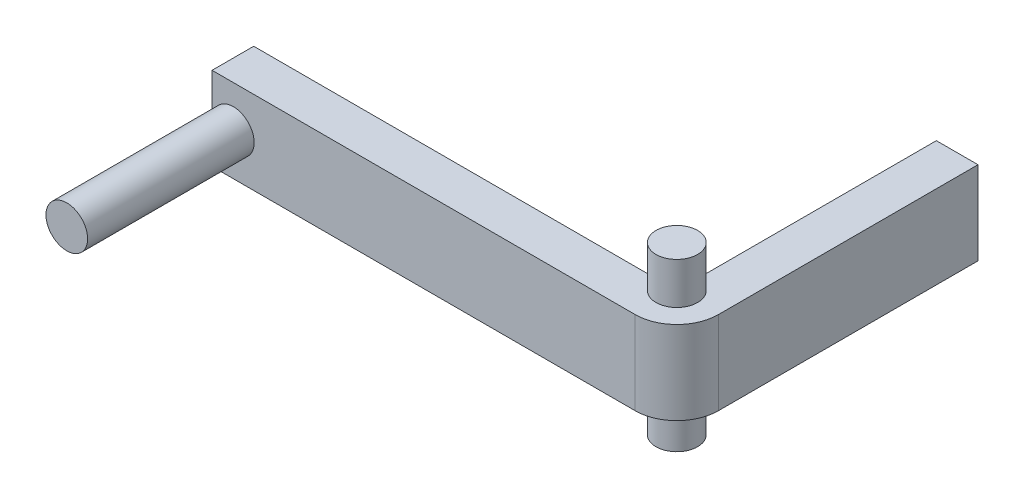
from build123d import *

# Parameters (mm, degrees)
BOSS_EXTRUDE1_DEPTH      = 1.5875
BOSS_EXTRUDE1_DEPTH_BACK = 1.5875
BOSS_EXTRUDE2_DEPTH      = 3.175
BOSS_EXTRUDE2_DEPTH_BACK = 3.175
SKETCH1_3_R              = 0.79375
SKETCH2_R                = 0.79375
BOSS_EXTRUDE3_DEPTH      = 6.35


with BuildPart() as part:
    # Sketch1 → Boss-Extrude1 (new, two sides: drawn at the far end of the back side and taken through both)
    with BuildSketch(Plane(origin=(0, 0, 0), x_dir=(1, 0, 0), z_dir=(0, 1, 0)).offset(-BOSS_EXTRUDE1_DEPTH_BACK)):
        with BuildLine():
            Line((-17.715743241, 1.5875), (-17.715743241, 0))
            Line((-17.715743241, 0), (-1.5875, 0))
            ThreePointArc((-1.5875, 0), (-0.464967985, 0.464967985), (0, 1.5875))
            Line((0, 1.5875), (0, 11.481839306))
            Line((0, 11.481839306), (-1.5875, 11.481839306))
            Line((-1.5875, 11.481839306), (-1.5875, 2.38125))
            ThreePointArc((-1.5875, 2.38125), (-1.026233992, 2.148766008), (-0.79375, 1.5875))
            ThreePointArc((-0.79375, 1.5875), (-1.5875, 0.79375), (-2.38125, 1.5875))
            Line((-2.38125, 1.5875), (-17.715743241, 1.5875))
        make_face()
    extrude(amount=BOSS_EXTRUDE1_DEPTH + BOSS_EXTRUDE1_DEPTH_BACK)

    # Sketch1_3 → Boss-Extrude2 (add, two sides: drawn at the far end of the back side and taken through both)
    with BuildSketch(Plane(origin=(0, 0, 0), x_dir=(1, 0, 0), z_dir=(0, 1, 0)).offset(-BOSS_EXTRUDE2_DEPTH_BACK)):
        with Locations(Location((-1.5875, 1.5875, 0), (0, 0, 270))):
            Circle(SKETCH1_3_R)
    extrude(amount=BOSS_EXTRUDE2_DEPTH + BOSS_EXTRUDE2_DEPTH_BACK)

    # Sketch2 → Boss-Extrude3 (add)
    with BuildSketch(Plane.XY):
        with Locations((-16.90409399, 0)):
            Circle(SKETCH2_R)
    extrude(amount=BOSS_EXTRUDE3_DEPTH)


solid = part.part
